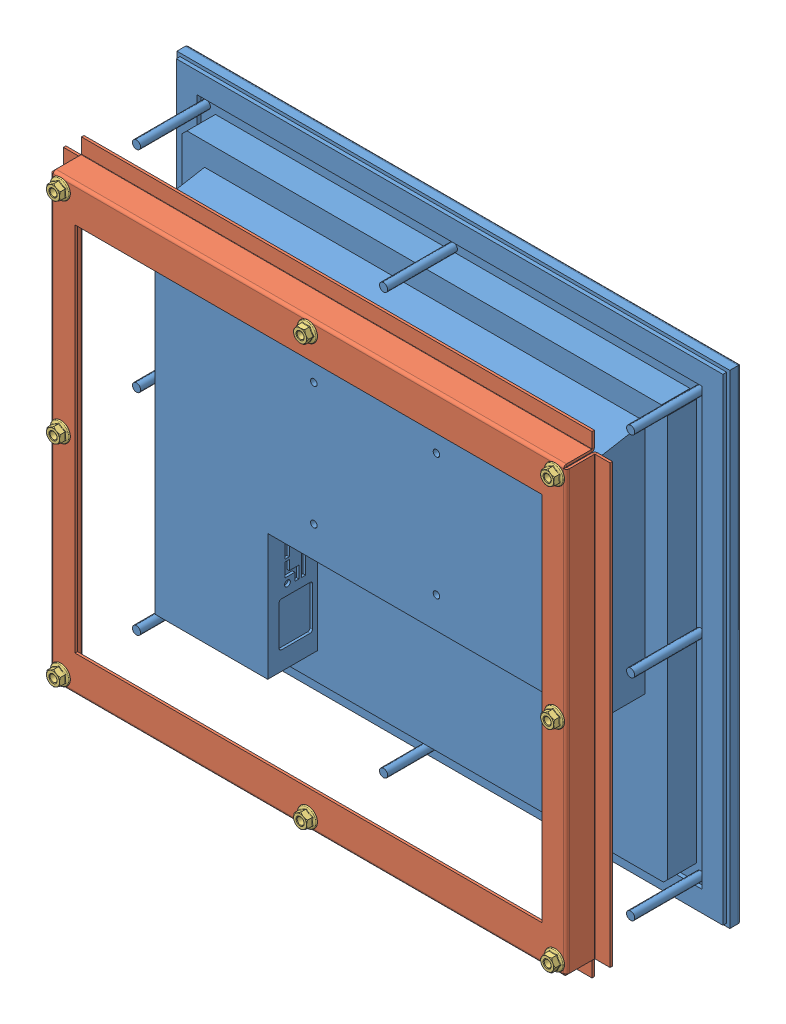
SolidWorks assembly 12 inch Panel Mount Monitor, HIS-ML12-xxxE.SLDASM, configuration Default (file format 10000). Lengths in mm.
Overall size (338.12 295.66 100.86).
10 component instances, 3 part files, 18 mates.
Components (placement in the parent):
- Monitor, 12E-1: Monitor, 12E.sldprt [Default] at (-159.1329 -466.8768 -14.4973) size (338.12 295.66 54.97)
- Collar, 10031-1: Collar, 10031.sldprt [Default] at (169.182 -147.8152 72.7278) size (334.31 289.38 18.8)
- M5 Nut, 30008-1: M5 Nut, 30008.sldprt [M5 Nut - 30008] at (17.9758 -19.2023 79.2467) size (11.8 11.8 5)
- M5 Nut, 30008-2: M5 Nut, 30008.sldprt [M5 Nut - 30008] at (169.0804 -19.2023 79.2467) x (0 -1 0) z (0 0 1) size (11.8 11.8 5)
- M5 Nut, 30008-3: M5 Nut, 30008.sldprt [M5 Nut - 30008] at (320.185 -19.2023 79.2467) size (11.8 11.8 5)
- M5 Nut, 30008-4: M5 Nut, 30008.sldprt [M5 Nut - 30008] at (320.185 -147.8279 79.2467) size (11.8 11.8 5)
- M5 Nut, 30008-5: M5 Nut, 30008.sldprt [M5 Nut - 30008] at (320.185 -276.4535 79.2467) x (0 -1 0) z (0 0 1) size (11.8 11.8 5)
- M5 Nut, 30008-6: M5 Nut, 30008.sldprt [M5 Nut - 30008] at (169.0804 -276.4535 79.2467) size (11.8 11.8 5)
- M5 Nut, 30008-7: M5 Nut, 30008.sldprt [M5 Nut - 30008] at (17.9758 -276.4535 79.2467) size (11.8 11.8 5)
- M5 Nut, 30008-8: M5 Nut, 30008.sldprt [M5 Nut - 30008] at (17.9758 -147.8279 79.2467) size (11.8 11.8 5)
Mates (geometry in assembly coordinates):
- Concentric1: concentric: cylinder of Monitor, 12E-1 through (320.185 -19.2023 28.2027) axis (0 0 -1) radius 2.5; cylinder of Collar, 10031-1 through (320.185 -19.2023 52.1523) axis (0 0 1) radius 3.175
- Parallel1: parallel anti-aligned: line of Monitor, 12E-1 through (338.1248 0 -14.4973) axis (-1 0 0); line of Collar, 10031-1 through (13.0754 -3.1241 34.8752) axis (1 0 0)
- Concentric21: concentric: cylinder of Collar, 10031-1 through (17.9758 -19.2023 74.2467) axis (0 0 1) radius 3.175; cylinder of M5 Nut, 30008-1 through (11.8529 -29.5918 45.2732) axis (0 0 1) radius 2.5
- Coincident21: coincident: plane of Collar, 10031-1 through (169.182 -147.8152 74.2467) normal (0 0 1); plane of M5 Nut, 30008-1 through (11.8529 -24.973 65.3107) normal (0 0 -1)
- Concentric31: concentric: cylinder of Collar, 10031-1 through (169.0804 -19.2023 74.2467) axis (0 0 1) radius 3.175; cylinder of M5 Nut, 30008-2 through (109.0045 -78.6047 -2.8734) axis (0 0 1) radius 2.5
- Coincident31: coincident: plane of Collar, 10031-1 through (169.182 -147.8152 74.2467) normal (0 0 1); plane of M5 Nut, 30008-2 through (113.6233 -78.6047 17.1641) normal (0 0 -1)
- Concentric41: concentric: cylinder of Collar, 10031-1 through (320.185 -19.2023 74.2467) axis (0 0 1) radius 3.175; cylinder of M5 Nut, 30008-3 through (211.1125 -127.8119 -55.7821) axis (0 0 1) radius 2.5
- Coincident41: coincident: plane of Collar, 10031-1 through (169.182 -147.8152 74.2467) normal (0 0 1); plane of M5 Nut, 30008-3 through (211.1125 -123.1931 -35.7446) normal (0 0 -1)
- Concentric51: concentric: cylinder of Collar, 10031-1 through (320.185 -147.8279 74.2467) axis (0 0 1) radius 3.175; cylinder of M5 Nut, 30008-4 through (252.353 -210.5686 -14.2795) axis (0 0 1) radius 2.5
- Coincident51: coincident: plane of Collar, 10031-1 through (169.182 -147.8152 74.2467) normal (0 0 1); plane of M5 Nut, 30008-4 through (252.353 -205.9498 5.758) normal (0 0 -1)
- Concentric61: concentric: cylinder of Collar, 10031-1 through (320.185 -276.4535 74.2467) axis (0 0 1) radius 3.175; cylinder of M5 Nut, 30008-5 through (296.8385 -297.1228 27.7751) axis (0 0 1) radius 2.5
- Coincident61: coincident: plane of Collar, 10031-1 through (169.182 -147.8152 74.2467) normal (0 0 1); plane of M5 Nut, 30008-5 through (301.4573 -297.1228 47.8127) normal (0 0 -1)
- Concentric71: concentric: cylinder of Collar, 10031-1 through (169.0804 -276.4535 74.2467) axis (0 0 1) radius 3.175; cylinder of M5 Nut, 30008-6 through (197.4271 -250.7662 80.8376) axis (0 0 1) radius 2.5
- Coincident71: coincident: plane of Collar, 10031-1 through (169.182 -147.8152 74.2467) normal (0 0 1); plane of M5 Nut, 30008-6 through (197.4271 -246.1474 100.8751) normal (0 0 -1)
- Concentric81: concentric: cylinder of Collar, 10031-1 through (17.9758 -276.4535 74.2467) axis (0 0 1) radius 3.175; cylinder of M5 Nut, 30008-7 through (97.859 -200.6952 130.3428) axis (0 0 1) radius 2.5
- Coincident81: coincident: plane of Collar, 10031-1 through (169.182 -147.8152 74.2467) normal (0 0 1); plane of M5 Nut, 30008-7 through (97.859 -196.0764 150.3803) normal (0 0 -1)
- Concentric91: concentric: cylinder of Collar, 10031-1 through (17.9758 -147.8279 74.2467) axis (0 0 1) radius 3.175; cylinder of M5 Nut, 30008-8 through (55.051 -115.0006 87.47) axis (0 0 1) radius 2.5
- Coincident91: coincident: plane of Collar, 10031-1 through (169.182 -147.8152 74.2467) normal (0 0 1); plane of M5 Nut, 30008-8 through (55.051 -110.3818 107.5075) normal (0 0 -1)
